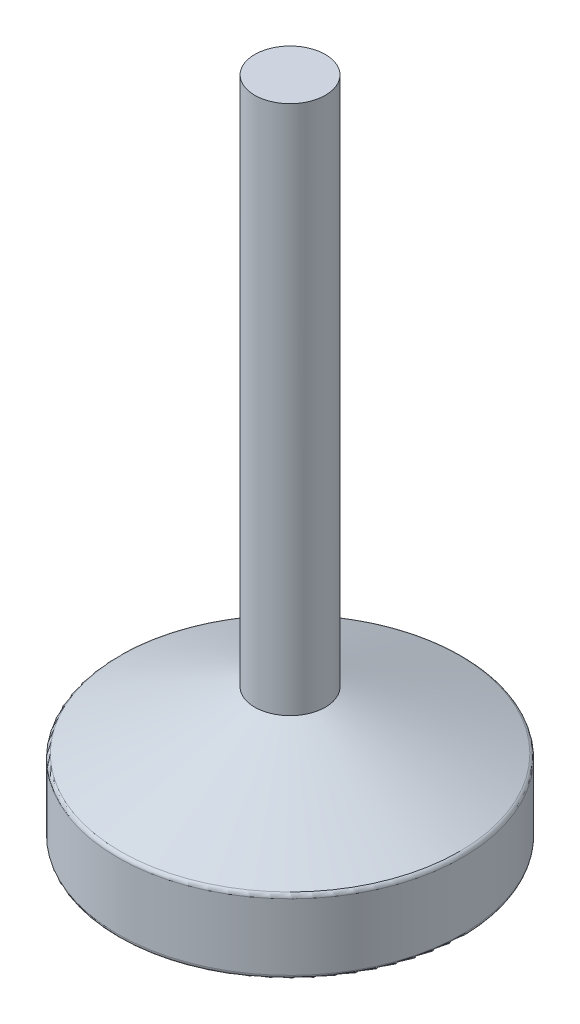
from build123d import *


with BuildPart() as part:
    # Sketch 1 → Revolve 1 (revolve)
    with BuildSketch(Plane.XY, mode=Mode.PRIVATE) as revolve_1_sk:
        with BuildLine():
            Line((0, 0), (0, -150))
            Line((0, -150), (37.999548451, -150))
            ThreePointArc((37.999548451, -150), (38.706655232, -149.707106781), (38.999548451, -149))
            Line((38.999548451, -149), (38.999548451, -134))
            ThreePointArc((38.999548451, -134), (38.834810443, -133.450147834), (38.394873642, -133.081458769))
            Line((38.394873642, -133.081458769), (8, -120))
            Line((8, -120), (8, 0))
            Line((8, 0), (0, 0))
        make_face()
    revolve(revolve_1_sk.sketch.rotate(Axis((0, 10.360590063, 0), (0, -1, 0)), 90), axis=Axis((0, 10.360590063, 0), (0, -1, 0)))


solid = part.part
